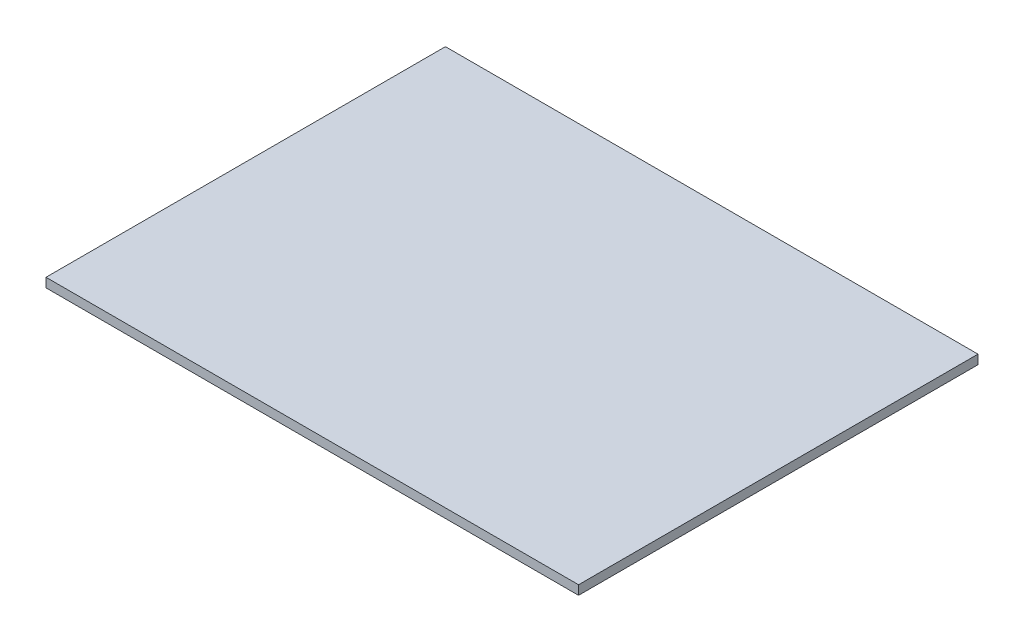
from build123d import *

# Parameters (mm, degrees)
ESQUISSE1_W        = 58
ESQUISSE1_H        = 43.5
BOSS_EXTRU_1_DEPTH = 1


with BuildPart() as part:
    # Esquisse1 → Boss.-Extru.1 (new body)
    with BuildSketch(Plane(origin=(0, 0, 0), x_dir=(1, 0, 0), z_dir=(0, 1, 0))):
        with Locations((29, 21.75)):
            Rectangle(ESQUISSE1_W, ESQUISSE1_H)
    extrude(amount=BOSS_EXTRU_1_DEPTH)


solid = part.part
